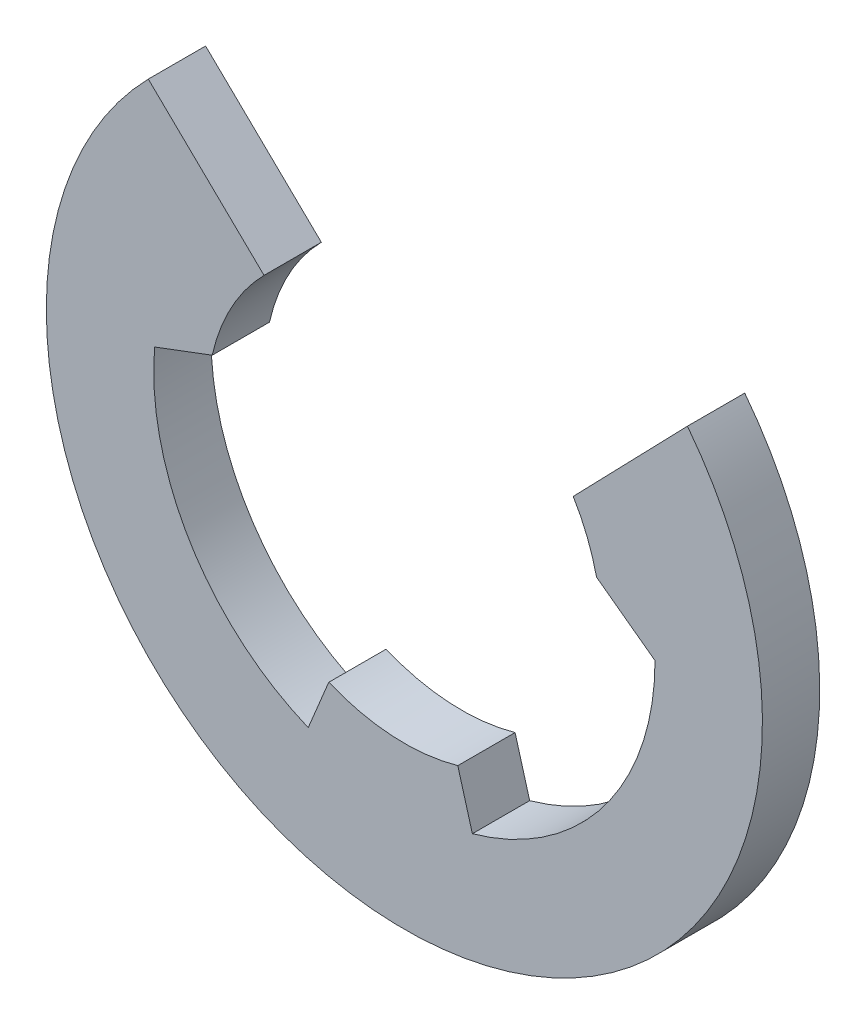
from build123d import *

# Parameters (mm, degrees)
BASE_EXTRUSION_DEPTH = 0.8


with BuildPart() as part:
    # Esquisse1 → Base-Extrusion (new body)
    with BuildSketch(Plane.XY):
        with BuildLine():
            Line((-2.683455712, 0.601303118), (-3.487211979, 0.298919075))
            ThreePointArc((-3.487211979, 0.298919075), (-2.991694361, -1.816525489), (-1.343301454, -3.23195625))
            Line((-1.343301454, -3.23195625), (-1.055451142, -2.539394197))
            ThreePointArc((-1.055451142, -2.539394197), (-0.163792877, -2.745117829), (0.746001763, -2.646881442))
            Line((0.746001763, -2.646881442), (0.949456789, -3.368758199))
            ThreePointArc((0.949456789, -3.368758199), (2.790438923, -2.112688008), (3.5, 0))
            Line((3.5, 0), (2.683455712, 0.601303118))
            ThreePointArc((2.683455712, 0.601303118), (2.553328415, 1.021280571), (2.357932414, 1.415151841))
            Line((2.357932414, 1.415151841), (3.952840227, 3.06187102))
            ThreePointArc((3.952840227, 3.06187102), (-0.28703278, -4.991754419), (-3.575823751, 3.494779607))
            Line((-3.575823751, 3.494779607), (-1.959580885, 1.929389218))
            ThreePointArc((-1.959580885, 1.929389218), (-2.414622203, 1.316092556), (-2.683455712, 0.601303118))
        make_face()
    extrude(amount=BASE_EXTRUSION_DEPTH)


solid = part.part
